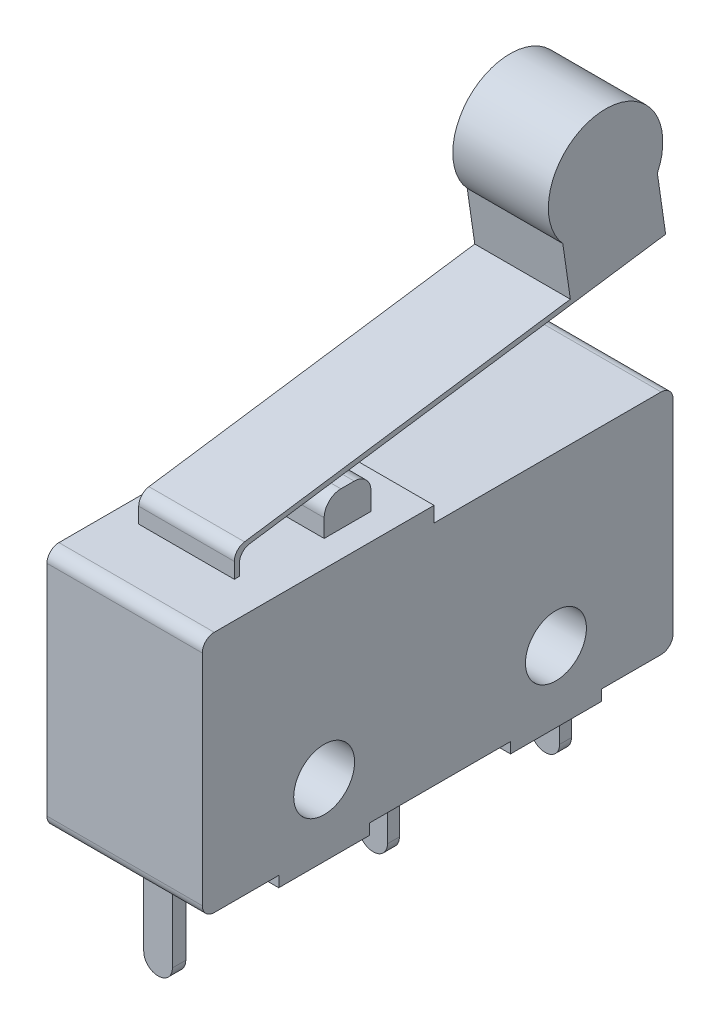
from build123d import *

# Parameters (mm, degrees)
SKETCH1_R           = 1.275
BOSS_EXTRUDE1_DEPTH = 6.5
SKETCH2_W           = 3.53
SKETCH2_H           = 1.96
BOSS_EXTRUDE2_DEPTH = 1.45
FILLET1_R           = 0.7
SKETCH3_W           = 3.2
SKETCH3_H           = 0.56
SKETCH3_H_2         = 0.5
BOSS_EXTRUDE3_DEPTH = 0.9
SKETCH4_W           = 1.2
SKETCH4_H           = 0.56
SKETCH4_H_2         = 0.5
BOSS_EXTRUDE4_DEPTH = 3.47
FILLET2_R           = 0.59
EXTRUDE_START       = -1.5
EXTRUDE_1_DEPTH     = 4
FILLET_1_R          = 0.5


with BuildPart() as part:
    # Sketch1 → Boss-Extrude1 (new body)
    with BuildSketch(Plane(origin=(0, 0, 0), x_dir=(0, 0, -1), z_dir=(1, 0, 0))):
        with BuildLine():
            Line((-37.373122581, 0), (-34.673122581, 0))
            Line((-34.673122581, 0), (-34.673122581, -0.45))
            Line((-34.673122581, -0.45), (-30.873122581, -0.45))
            Line((-30.873122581, -0.45), (-30.873122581, 0))
            Line((-30.873122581, 0), (-24.973122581, 0))
            Line((-24.973122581, 0), (-24.973122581, -0.45))
            Line((-24.973122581, -0.45), (-21.173122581, -0.45))
            Line((-21.173122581, -0.45), (-21.173122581, 0))
            Line((-21.173122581, 0), (-18.673122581, 0))
            ThreePointArc((-18.673122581, 0), (-18.31956919, 0.146446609), (-18.173122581, 0.5))
            Line((-18.173122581, 0.5), (-18.173122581, 9.02))
            ThreePointArc((-18.173122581, 9.02), (-18.31956919, 9.373553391), (-18.673122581, 9.52))
            Line((-18.673122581, 9.52), (-28.173122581, 9.52))
            Line((-28.173122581, 9.52), (-28.173122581, 10.16))
            Line((-28.173122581, 10.16), (-37.373122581, 10.16))
            ThreePointArc((-37.373122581, 10.16), (-37.726675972, 10.013553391), (-37.873122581, 9.66))
            Line((-37.873122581, 9.66), (-37.873122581, 0.5))
            ThreePointArc((-37.873122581, 0.5), (-37.726675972, 0.146446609), (-37.373122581, 0))
        make_face()
        with Locations(Location((-32.773122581, 2.525, 0), (0, 0, 180))):
            Circle(SKETCH1_R, mode=Mode.SUBTRACT)
        with Locations(Location((-23.073122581, 2.525, 0), (0, 0, 180))):
            Circle(SKETCH1_R, mode=Mode.SUBTRACT)
    extrude(amount=BOSS_EXTRUDE1_DEPTH)

    # Sketch2 → Boss-Extrude2 (add)
    with BuildSketch(Plane(origin=(0, 10.16, 0), x_dir=(1, 0, 0), z_dir=(0, 1, 0))):
        with Locations((3.635, -30.693122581)):
            Rectangle(SKETCH2_W, SKETCH2_H)
    extrude(amount=BOSS_EXTRUDE2_DEPTH)

    # Fillet1
    fillet1_edges = [part.edges().sort_by_distance(p)[0] for p in [
        (3.635, 11.61, 31.673122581),
        (3.635, 11.61, 29.713122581),
    ]]
    fillet(fillet1_edges, radius=FILLET1_R)

    # Sketch3 → Boss-Extrude3 (add)
    with BuildSketch(Plane(origin=(0, 0, 0), x_dir=(-1, 0, 0), z_dir=(0, -1, 0))):
        with Locations((-3.25, -36.193122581)):
            Rectangle(SKETCH3_W, SKETCH3_H)
        with Locations((-3.25, -27.223122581)):
            Rectangle(SKETCH3_W, SKETCH3_H_2)
        with Locations((-3.25, -20.023122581)):
            Rectangle(SKETCH3_W, SKETCH3_H_2)
    extrude(amount=BOSS_EXTRUDE3_DEPTH)

    # Sketch4 → Boss-Extrude4 (add)
    with BuildSketch(Plane(origin=(0, -0.9, 0), x_dir=(-1, 0, 0), z_dir=(0, -1, 0))):
        with Locations((-3.25, -36.193122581)):
            Rectangle(SKETCH4_W, SKETCH4_H)
        with Locations((-3.25, -27.223122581)):
            Rectangle(SKETCH4_W, SKETCH4_H_2)
        with Locations((-3.25, -20.023122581)):
            Rectangle(SKETCH4_W, SKETCH4_H_2)
    extrude(amount=BOSS_EXTRUDE4_DEPTH)

    # Fillet2
    fillet2_edges = [part.edges().sort_by_distance(p)[0] for p in [
        (2.65, -4.37, 36.193122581),
        (3.85, -4.37, 36.193122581),
        (2.65, -4.37, 27.223122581),
        (3.85, -4.37, 27.223122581),
        (3.85, -4.37, 20.023122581),
        (2.65, -4.37, 20.023122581),
    ]]
    fillet(fillet2_edges, radius=FILLET2_R)

    # Sketch 1 → Extrude 1 (add)
    with BuildSketch(Plane(origin=(6.5, 0, 0), x_dir=(0, 0, -1), z_dir=(1, 0, 0)).offset(EXTRUDE_START)):
        with BuildLine():
            Line((-35.033122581, 10.16), (-34.820611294, 10.16))
            Line((-34.820611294, 10.16), (-34.820611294, 11.065475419))
            Line((-34.820611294, 11.065475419), (-16.983122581, 13.639958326))
            Line((-16.983122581, 13.639958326), (-17.327590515, 16.026629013))
            ThreePointArc((-17.327590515, 16.026629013), (-19.152479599, 14.674662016), (-21.2856409, 15.454186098))
            Line((-21.2856409, 15.454186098), (-20.970513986, 13.279774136))
            Line((-20.970513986, 13.279774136), (-35.033122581, 11.241748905))
            Line((-35.033122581, 11.241748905), (-35.033122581, 10.16))
        make_face()
        with BuildLine():
            ThreePointArc((-21.2856409, 15.454186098), (-19.152479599, 14.674662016), (-17.327590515, 16.026629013))
            Line((-17.327590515, 16.026629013), (-17.515806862, 17.330699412))
            ThreePointArc((-17.515806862, 17.330699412), (-19.781572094, 19.024405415), (-21.474617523, 16.75814654))
            Line((-21.474617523, 16.75814654), (-21.2856409, 15.454186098))
        make_face()
        with BuildLine():
            Line((-17.515806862, 17.330699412), (-17.327590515, 16.026629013))
            ThreePointArc((-17.327590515, 16.026629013), (-17.157809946, 16.523285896), (-17.100295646, 17.045))
            ThreePointArc((-17.100295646, 17.045), (-17.801774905, 18.738520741), (-19.495295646, 19.44))
            ThreePointArc((-19.495295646, 19.44), (-21.680018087, 18.026332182), (-21.2856409, 15.454186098))
            Line((-21.2856409, 15.454186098), (-21.474617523, 16.75814654))
            ThreePointArc((-21.474617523, 16.75814654), (-19.781572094, 19.024405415), (-17.515806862, 17.330699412))
        make_face()
        with BuildLine():
            ThreePointArc((-21.2856409, 15.454186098), (-19.152479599, 14.674662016), (-17.327590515, 16.026629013))
            Line((-17.327590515, 16.026629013), (-17.515806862, 17.330699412))
            ThreePointArc((-17.515806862, 17.330699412), (-19.781572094, 19.024405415), (-21.474617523, 16.75814654))
            Line((-21.474617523, 16.75814654), (-21.2856409, 15.454186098))
        make_face()
        with BuildLine():
            Line((-17.515806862, 17.330699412), (-17.327590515, 16.026629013))
            ThreePointArc((-17.327590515, 16.026629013), (-17.157809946, 16.523285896), (-17.100295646, 17.045))
            ThreePointArc((-17.100295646, 17.045), (-17.801774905, 18.738520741), (-19.495295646, 19.44))
            ThreePointArc((-19.495295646, 19.44), (-21.680018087, 18.026332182), (-21.2856409, 15.454186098))
            Line((-21.2856409, 15.454186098), (-21.474617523, 16.75814654))
            ThreePointArc((-21.474617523, 16.75814654), (-19.781572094, 19.024405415), (-17.515806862, 17.330699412))
        make_face()
    extrude(amount=-EXTRUDE_1_DEPTH)

    # Fillet 1
    fillet_1_edges = [part.edges().sort_by_distance(p)[0] for p in [
        (3, 11.065475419, 34.820611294),
        (3, 11.241748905, 35.033122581),
    ]]
    fillet(fillet_1_edges, radius=FILLET_1_R)


solid = part.part
